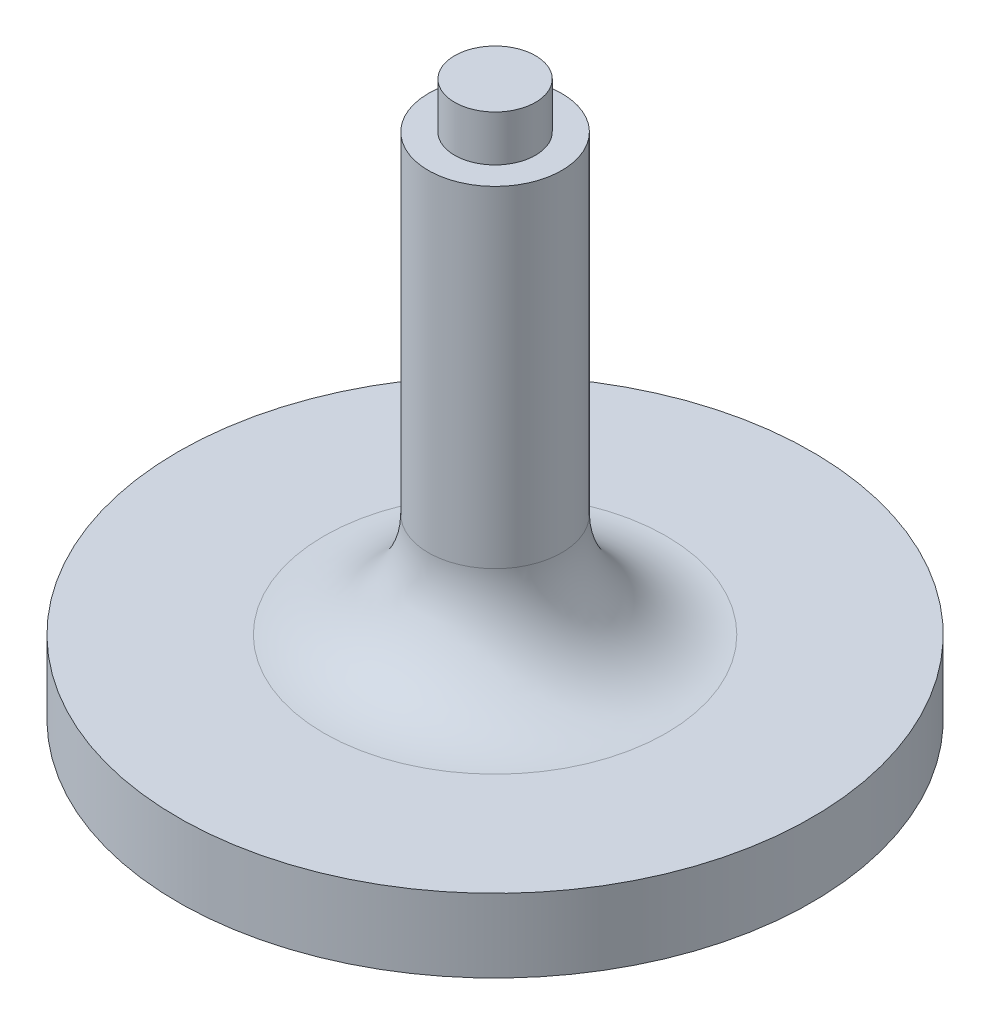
ISO-10303-21;
HEADER;
FILE_DESCRIPTION(('STEP AP214'),'2;1');
FILE_NAME('part.step','',(''),(''),'','','');
FILE_SCHEMA(('AUTOMOTIVE_DESIGN { 1 0 10303 214 1 1 1 1 }'));
ENDSEC;
DATA;
#1=APPLICATION_CONTEXT('core data for automotive mechanical design processes');
#2=APPLICATION_PROTOCOL_DEFINITION('international standard','automotive_design',2000,#1);
#3=PRODUCT_CONTEXT('',#1,'mechanical');
#4=PRODUCT('Part','Part','',(#3));
#5=PRODUCT_RELATED_PRODUCT_CATEGORY('part','',(#4));
#6=PRODUCT_DEFINITION_FORMATION('','',#4);
#7=PRODUCT_DEFINITION_CONTEXT('part definition',#1,'design');
#8=PRODUCT_DEFINITION('design','',#6,#7);
#9=PRODUCT_DEFINITION_SHAPE('','',#8);
#10=(LENGTH_UNIT() NAMED_UNIT(*) SI_UNIT(.MILLI.,.METRE.));
#11=(NAMED_UNIT(*) PLANE_ANGLE_UNIT() SI_UNIT($,.RADIAN.));
#12=(NAMED_UNIT(*) SI_UNIT($,.STERADIAN.) SOLID_ANGLE_UNIT());
#13=UNCERTAINTY_MEASURE_WITH_UNIT(LENGTH_MEASURE(1.E-05),#10,'distance_accuracy_value','');
#14=(GEOMETRIC_REPRESENTATION_CONTEXT(3) GLOBAL_UNCERTAINTY_ASSIGNED_CONTEXT((#13)) GLOBAL_UNIT_ASSIGNED_CONTEXT((#10,
#11,#12)) REPRESENTATION_CONTEXT('',''));
#15=CARTESIAN_POINT('',(0.,0.,0.));
#16=DIRECTION('',(0.,0.,1.));
#17=DIRECTION('',(1.,0.,0.));
#18=AXIS2_PLACEMENT_3D('',#15,#16,#17);
#19=CARTESIAN_POINT('',(0.,-16.891,0.));
#20=DIRECTION('',(0.,1.,0.));
#21=DIRECTION('',(-1.,0.,0.));
#22=AXIS2_PLACEMENT_3D('',#19,#20,#21);
#23=PLANE('',#22);
#24=CARTESIAN_POINT('',(0.,-16.891,0.));
#25=DIRECTION('',(0.,1.,0.));
#26=DIRECTION('',(-1.,0.,0.));
#27=AXIS2_PLACEMENT_3D('',#24,#25,#26);
#28=CIRCLE('',#27,9.652);
#29=CARTESIAN_POINT('',(-9.652,-16.891,0.));
#30=VERTEX_POINT('',#29);
#31=EDGE_CURVE('E10',#30,#30,#28,.T.);
#32=ORIENTED_EDGE('',*,*,#31,.F.);
#33=EDGE_LOOP('',(#32));
#34=FACE_BOUND('',#33,.T.);
#35=ADVANCED_FACE('F34',(#34),#23,.F.);
#36=CARTESIAN_POINT('',(0.,0.,0.));
#37=DIRECTION('',(0.,1.,0.));
#38=DIRECTION('',(-1.,0.,0.));
#39=AXIS2_PLACEMENT_3D('',#36,#37,#38);
#40=CYLINDRICAL_SURFACE('',#39,9.652);
#41=CARTESIAN_POINT('',(0.,-14.6558,0.));
#42=DIRECTION('',(0.,1.,0.));
#43=DIRECTION('',(-1.,0.,0.));
#44=AXIS2_PLACEMENT_3D('',#41,#42,#43);
#45=CIRCLE('',#44,9.652);
#46=CARTESIAN_POINT('',(-9.652,-14.6558,0.));
#47=VERTEX_POINT('',#46);
#48=EDGE_CURVE('E40',#47,#47,#45,.T.);
#49=ORIENTED_EDGE('',*,*,#48,.F.);
#50=EDGE_LOOP('',(#49));
#51=FACE_BOUND('',#50,.T.);
#52=ORIENTED_EDGE('',*,*,#31,.T.);
#53=EDGE_LOOP('',(#52));
#54=FACE_BOUND('',#53,.T.);
#55=ADVANCED_FACE('F91',(#51,#54),#40,.T.);
#56=CARTESIAN_POINT('',(9.652,-14.6558,0.));
#57=DIRECTION('',(0.,-1.,0.));
#58=DIRECTION('',(1.,0.,0.));
#59=AXIS2_PLACEMENT_3D('',#56,#57,#58);
#60=PLANE('',#59);
#61=CARTESIAN_POINT('',(0.,-14.6558,0.));
#62=DIRECTION('',(0.,1.,0.));
#63=DIRECTION('',(-1.,0.,0.));
#64=AXIS2_PLACEMENT_3D('',#61,#62,#63);
#65=CIRCLE('',#64,5.20700000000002);
#66=CARTESIAN_POINT('',(-5.20700000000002,-14.6558,0.));
#67=VERTEX_POINT('',#66);
#68=EDGE_CURVE('E44',#67,#67,#65,.T.);
#69=ORIENTED_EDGE('',*,*,#68,.F.);
#70=EDGE_LOOP('',(#69));
#71=FACE_BOUND('',#70,.T.);
#72=ORIENTED_EDGE('',*,*,#48,.T.);
#73=EDGE_LOOP('',(#72));
#74=FACE_BOUND('',#73,.T.);
#75=ADVANCED_FACE('F86',(#71,#74),#60,.F.);
#76=CARTESIAN_POINT('',(0.,-11.4808,0.));
#77=DIRECTION('',(0.,1.,0.));
#78=DIRECTION('',(-1.,0.,0.));
#79=AXIS2_PLACEMENT_3D('',#76,#77,#78);
#80=TOROIDAL_SURFACE('',#79,5.207,3.175);
#81=CARTESIAN_POINT('',(0.,-11.4808,0.));
#82=DIRECTION('',(0.,1.,0.));
#83=DIRECTION('',(-1.,0.,0.));
#84=AXIS2_PLACEMENT_3D('',#81,#82,#83);
#85=CIRCLE('',#84,2.032);
#86=CARTESIAN_POINT('',(-2.032,-11.4808,0.));
#87=VERTEX_POINT('',#86);
#88=EDGE_CURVE('E48',#87,#87,#85,.T.);
#89=ORIENTED_EDGE('',*,*,#88,.F.);
#90=EDGE_LOOP('',(#89));
#91=FACE_BOUND('',#90,.T.);
#92=ORIENTED_EDGE('',*,*,#68,.T.);
#93=EDGE_LOOP('',(#92));
#94=FACE_BOUND('',#93,.T.);
#95=ADVANCED_FACE('F80',(#91,#94),#80,.F.);
#96=CARTESIAN_POINT('',(0.,0.,0.));
#97=DIRECTION('',(0.,1.,0.));
#98=DIRECTION('',(-1.,0.,0.));
#99=AXIS2_PLACEMENT_3D('',#96,#97,#98);
#100=CYLINDRICAL_SURFACE('',#99,2.032);
#101=CARTESIAN_POINT('',(0.,-1.397,0.));
#102=DIRECTION('',(0.,1.,0.));
#103=DIRECTION('',(-1.,0.,0.));
#104=AXIS2_PLACEMENT_3D('',#101,#102,#103);
#105=CIRCLE('',#104,2.032);
#106=CARTESIAN_POINT('',(-2.032,-1.397,0.));
#107=VERTEX_POINT('',#106);
#108=EDGE_CURVE('E53',#107,#107,#105,.T.);
#109=ORIENTED_EDGE('',*,*,#108,.F.);
#110=EDGE_LOOP('',(#109));
#111=FACE_BOUND('',#110,.T.);
#112=ORIENTED_EDGE('',*,*,#88,.T.);
#113=EDGE_LOOP('',(#112));
#114=FACE_BOUND('',#113,.T.);
#115=ADVANCED_FACE('F74',(#111,#114),#100,.T.);
#116=CARTESIAN_POINT('',(2.032,-1.397,0.));
#117=DIRECTION('',(0.,-1.,0.));
#118=DIRECTION('',(1.,0.,0.));
#119=AXIS2_PLACEMENT_3D('',#116,#117,#118);
#120=PLANE('',#119);
#121=CARTESIAN_POINT('',(0.,-1.397,0.));
#122=DIRECTION('',(0.,1.,0.));
#123=DIRECTION('',(-1.,0.,0.));
#124=AXIS2_PLACEMENT_3D('',#121,#122,#123);
#125=CIRCLE('',#124,1.2319);
#126=CARTESIAN_POINT('',(-1.2319,-1.397,0.));
#127=VERTEX_POINT('',#126);
#128=EDGE_CURVE('E56',#127,#127,#125,.T.);
#129=ORIENTED_EDGE('',*,*,#128,.F.);
#130=EDGE_LOOP('',(#129));
#131=FACE_BOUND('',#130,.T.);
#132=ORIENTED_EDGE('',*,*,#108,.T.);
#133=EDGE_LOOP('',(#132));
#134=FACE_BOUND('',#133,.T.);
#135=ADVANCED_FACE('F68',(#131,#134),#120,.F.);
#136=CARTESIAN_POINT('',(0.,0.,0.));
#137=DIRECTION('',(0.,1.,0.));
#138=DIRECTION('',(-1.,0.,0.));
#139=AXIS2_PLACEMENT_3D('',#136,#137,#138);
#140=CYLINDRICAL_SURFACE('',#139,1.2319);
#141=CARTESIAN_POINT('',(0.,0.,0.));
#142=DIRECTION('',(0.,1.,0.));
#143=DIRECTION('',(-1.,0.,0.));
#144=AXIS2_PLACEMENT_3D('',#141,#142,#143);
#145=CIRCLE('',#144,1.2319);
#146=CARTESIAN_POINT('',(-1.2319,0.,0.));
#147=VERTEX_POINT('',#146);
#148=EDGE_CURVE('E59',#147,#147,#145,.T.);
#149=ORIENTED_EDGE('',*,*,#148,.F.);
#150=EDGE_LOOP('',(#149));
#151=FACE_BOUND('',#150,.T.);
#152=ORIENTED_EDGE('',*,*,#128,.T.);
#153=EDGE_LOOP('',(#152));
#154=FACE_BOUND('',#153,.T.);
#155=ADVANCED_FACE('F65',(#151,#154),#140,.T.);
#156=CARTESIAN_POINT('',(1.2319,0.,0.));
#157=DIRECTION('',(0.,-1.,0.));
#158=DIRECTION('',(1.,0.,0.));
#159=AXIS2_PLACEMENT_3D('',#156,#157,#158);
#160=PLANE('',#159);
#161=ORIENTED_EDGE('',*,*,#148,.T.);
#162=EDGE_LOOP('',(#161));
#163=FACE_BOUND('',#162,.T.);
#164=ADVANCED_FACE('F63',(#163),#160,.F.);
#165=CLOSED_SHELL('',(#35,#55,#75,#95,#115,#135,#155,#164));
#166=MANIFOLD_SOLID_BREP('B2',#165);
#167=ADVANCED_BREP_SHAPE_REPRESENTATION('',(#18,#166),#14);
#168=SHAPE_DEFINITION_REPRESENTATION(#9,#167);
ENDSEC;
END-ISO-10303-21;
